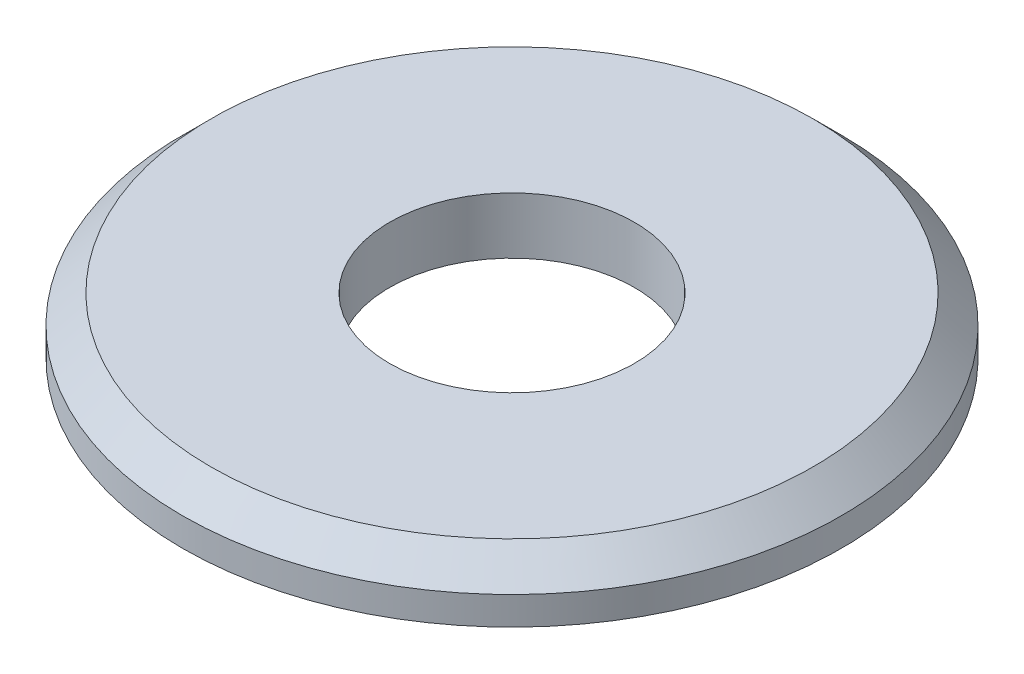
ISO-10303-21;
HEADER;
FILE_DESCRIPTION(('STEP AP214'),'2;1');
FILE_NAME('part.step','',(''),(''),'','','');
FILE_SCHEMA(('AUTOMOTIVE_DESIGN { 1 0 10303 214 1 1 1 1 }'));
ENDSEC;
DATA;
#1=APPLICATION_CONTEXT('core data for automotive mechanical design processes');
#2=APPLICATION_PROTOCOL_DEFINITION('international standard','automotive_design',2000,#1);
#3=PRODUCT_CONTEXT('',#1,'mechanical');
#4=PRODUCT('Part','Part','',(#3));
#5=PRODUCT_RELATED_PRODUCT_CATEGORY('part','',(#4));
#6=PRODUCT_DEFINITION_FORMATION('','',#4);
#7=PRODUCT_DEFINITION_CONTEXT('part definition',#1,'design');
#8=PRODUCT_DEFINITION('design','',#6,#7);
#9=PRODUCT_DEFINITION_SHAPE('','',#8);
#10=(LENGTH_UNIT() NAMED_UNIT(*) SI_UNIT(.MILLI.,.METRE.));
#11=(NAMED_UNIT(*) PLANE_ANGLE_UNIT() SI_UNIT($,.RADIAN.));
#12=(NAMED_UNIT(*) SI_UNIT($,.STERADIAN.) SOLID_ANGLE_UNIT());
#13=UNCERTAINTY_MEASURE_WITH_UNIT(LENGTH_MEASURE(1.E-05),#10,'distance_accuracy_value','');
#14=(GEOMETRIC_REPRESENTATION_CONTEXT(3) GLOBAL_UNCERTAINTY_ASSIGNED_CONTEXT((#13)) GLOBAL_UNIT_ASSIGNED_CONTEXT((#10,
#11,#12)) REPRESENTATION_CONTEXT('',''));
#15=CARTESIAN_POINT('',(0.,0.,0.));
#16=DIRECTION('',(0.,0.,1.));
#17=DIRECTION('',(1.,0.,0.));
#18=AXIS2_PLACEMENT_3D('',#15,#16,#17);
#19=CARTESIAN_POINT('',(0.,0.3,0.));
#20=DIRECTION('',(0.,1.,0.));
#21=DIRECTION('',(0.,0.,1.));
#22=AXIS2_PLACEMENT_3D('',#19,#20,#21);
#23=PLANE('',#22);
#24=CARTESIAN_POINT('',(0.,0.3,0.));
#25=DIRECTION('',(0.,1.,0.));
#26=DIRECTION('',(0.,0.,1.));
#27=AXIS2_PLACEMENT_3D('',#24,#25,#26);
#28=CIRCLE('',#27,1.6);
#29=CARTESIAN_POINT('',(0.,0.3,1.6));
#30=VERTEX_POINT('',#29);
#31=EDGE_CURVE('E35',#30,#30,#28,.T.);
#32=ORIENTED_EDGE('',*,*,#31,.T.);
#33=EDGE_LOOP('',(#32));
#34=FACE_BOUND('',#33,.T.);
#35=CARTESIAN_POINT('',(0.,0.3,0.));
#36=DIRECTION('',(0.,1.,0.));
#37=DIRECTION('',(0.,0.,1.));
#38=AXIS2_PLACEMENT_3D('',#35,#36,#37);
#39=CIRCLE('',#38,0.65);
#40=CARTESIAN_POINT('',(0.,0.3,0.65));
#41=VERTEX_POINT('',#40);
#42=EDGE_CURVE('E43',#41,#41,#39,.T.);
#43=ORIENTED_EDGE('',*,*,#42,.F.);
#44=EDGE_LOOP('',(#43));
#45=FACE_BOUND('',#44,.T.);
#46=ADVANCED_FACE('F28',(#34,#45),#23,.T.);
#47=CARTESIAN_POINT('',(0.,0.,0.));
#48=DIRECTION('',(0.,1.,0.));
#49=DIRECTION('',(0.,0.,1.));
#50=AXIS2_PLACEMENT_3D('',#47,#48,#49);
#51=PLANE('',#50);
#52=CARTESIAN_POINT('',(0.,0.,0.));
#53=DIRECTION('',(0.,1.,0.));
#54=DIRECTION('',(0.,0.,1.));
#55=AXIS2_PLACEMENT_3D('',#52,#53,#54);
#56=CIRCLE('',#55,1.75);
#57=CARTESIAN_POINT('',(0.,0.,1.75));
#58=VERTEX_POINT('',#57);
#59=EDGE_CURVE('E39',#58,#58,#56,.T.);
#60=ORIENTED_EDGE('',*,*,#59,.F.);
#61=EDGE_LOOP('',(#60));
#62=FACE_BOUND('',#61,.T.);
#63=CARTESIAN_POINT('',(0.,0.,0.));
#64=DIRECTION('',(0.,1.,0.));
#65=DIRECTION('',(0.,0.,1.));
#66=AXIS2_PLACEMENT_3D('',#63,#64,#65);
#67=CIRCLE('',#66,0.65);
#68=CARTESIAN_POINT('',(0.,0.,0.65));
#69=VERTEX_POINT('',#68);
#70=EDGE_CURVE('E48',#69,#69,#67,.T.);
#71=ORIENTED_EDGE('',*,*,#70,.T.);
#72=EDGE_LOOP('',(#71));
#73=FACE_BOUND('',#72,.T.);
#74=ADVANCED_FACE('F52',(#62,#73),#51,.F.);
#75=CARTESIAN_POINT('',(0.,0.3,0.));
#76=DIRECTION('',(0.,-1.,0.));
#77=DIRECTION('',(0.,0.,-1.));
#78=AXIS2_PLACEMENT_3D('',#75,#76,#77);
#79=CYLINDRICAL_SURFACE('',#78,1.75);
#80=CARTESIAN_POINT('',(0.,0.15,0.));
#81=DIRECTION('',(0.,1.,0.));
#82=DIRECTION('',(0.,0.,1.));
#83=AXIS2_PLACEMENT_3D('',#80,#81,#82);
#84=CIRCLE('',#83,1.75);
#85=CARTESIAN_POINT('',(0.,0.15,1.75));
#86=VERTEX_POINT('',#85);
#87=EDGE_CURVE('E10',#86,#86,#84,.F.);
#88=ORIENTED_EDGE('',*,*,#87,.T.);
#89=EDGE_LOOP('',(#88));
#90=FACE_BOUND('',#89,.T.);
#91=ORIENTED_EDGE('',*,*,#59,.T.);
#92=EDGE_LOOP('',(#91));
#93=FACE_BOUND('',#92,.T.);
#94=ADVANCED_FACE('F30',(#90,#93),#79,.T.);
#95=CARTESIAN_POINT('',(0.,0.3,0.));
#96=DIRECTION('',(0.,-1.,0.));
#97=DIRECTION('',(0.,0.,-1.));
#98=AXIS2_PLACEMENT_3D('',#95,#96,#97);
#99=CYLINDRICAL_SURFACE('',#98,0.65);
#100=ORIENTED_EDGE('',*,*,#42,.T.);
#101=EDGE_LOOP('',(#100));
#102=FACE_BOUND('',#101,.T.);
#103=ORIENTED_EDGE('',*,*,#70,.F.);
#104=EDGE_LOOP('',(#103));
#105=FACE_BOUND('',#104,.T.);
#106=ADVANCED_FACE('F54',(#102,#105),#99,.F.);
#107=CARTESIAN_POINT('',(0.,0.3,0.));
#108=DIRECTION('',(0.,-1.,0.));
#109=DIRECTION('',(0.,0.,-1.));
#110=AXIS2_PLACEMENT_3D('',#107,#108,#109);
#111=CONICAL_SURFACE('',#110,1.6,0.785398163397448);
#112=ORIENTED_EDGE('',*,*,#87,.F.);
#113=EDGE_LOOP('',(#112));
#114=FACE_BOUND('',#113,.T.);
#115=ORIENTED_EDGE('',*,*,#31,.F.);
#116=EDGE_LOOP('',(#115));
#117=FACE_BOUND('',#116,.T.);
#118=ADVANCED_FACE('F56',(#114,#117),#111,.T.);
#119=CLOSED_SHELL('',(#46,#74,#94,#106,#118));
#120=MANIFOLD_SOLID_BREP('B2',#119);
#121=ADVANCED_BREP_SHAPE_REPRESENTATION('',(#18,#120),#14);
#122=SHAPE_DEFINITION_REPRESENTATION(#9,#121);
ENDSEC;
END-ISO-10303-21;
